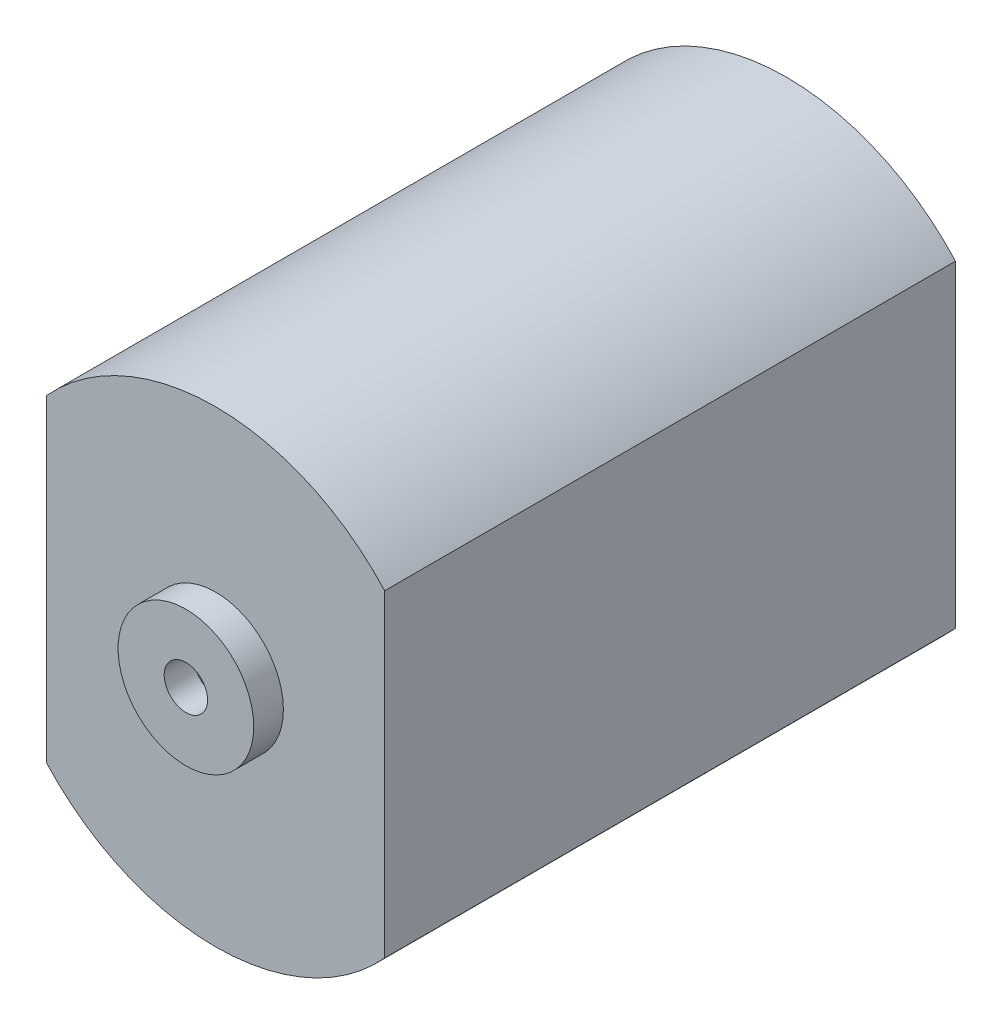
ISO-10303-21;
HEADER;
FILE_DESCRIPTION(('STEP AP214'),'2;1');
FILE_NAME('part.step','',(''),(''),'','','');
FILE_SCHEMA(('AUTOMOTIVE_DESIGN { 1 0 10303 214 1 1 1 1 }'));
ENDSEC;
DATA;
#1=APPLICATION_CONTEXT('core data for automotive mechanical design processes');
#2=APPLICATION_PROTOCOL_DEFINITION('international standard','automotive_design',2000,#1);
#3=PRODUCT_CONTEXT('',#1,'mechanical');
#4=PRODUCT('Part','Part','',(#3));
#5=PRODUCT_RELATED_PRODUCT_CATEGORY('part','',(#4));
#6=PRODUCT_DEFINITION_FORMATION('','',#4);
#7=PRODUCT_DEFINITION_CONTEXT('part definition',#1,'design');
#8=PRODUCT_DEFINITION('design','',#6,#7);
#9=PRODUCT_DEFINITION_SHAPE('','',#8);
#10=(LENGTH_UNIT() NAMED_UNIT(*) SI_UNIT(.MILLI.,.METRE.));
#11=(NAMED_UNIT(*) PLANE_ANGLE_UNIT() SI_UNIT($,.RADIAN.));
#12=(NAMED_UNIT(*) SI_UNIT($,.STERADIAN.) SOLID_ANGLE_UNIT());
#13=UNCERTAINTY_MEASURE_WITH_UNIT(LENGTH_MEASURE(1.E-05),#10,'distance_accuracy_value','');
#14=(GEOMETRIC_REPRESENTATION_CONTEXT(3) GLOBAL_UNCERTAINTY_ASSIGNED_CONTEXT((#13)) GLOBAL_UNIT_ASSIGNED_CONTEXT((#10,
#11,#12)) REPRESENTATION_CONTEXT('',''));
#15=CARTESIAN_POINT('',(0.,0.,0.));
#16=DIRECTION('',(0.,0.,1.));
#17=DIRECTION('',(1.,0.,0.));
#18=AXIS2_PLACEMENT_3D('',#15,#16,#17);
#19=CARTESIAN_POINT('',(-7.405,6.72056359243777,25.));
#20=DIRECTION('',(0.,0.,-1.));
#21=DIRECTION('',(-1.,0.,0.));
#22=AXIS2_PLACEMENT_3D('',#19,#20,#21);
#23=CYLINDRICAL_SURFACE('',#22,10.);
#24=CARTESIAN_POINT('',(-7.405,6.72056359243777,0.));
#25=DIRECTION('',(0.,0.,1.));
#26=DIRECTION('',(1.,0.,0.));
#27=AXIS2_PLACEMENT_3D('',#24,#25,#26);
#28=CIRCLE('',#27,10.);
#29=CARTESIAN_POINT('',(-14.81,0.,0.));
#30=VERTEX_POINT('',#29);
#31=CARTESIAN_POINT('',(0.,0.,0.));
#32=VERTEX_POINT('',#31);
#33=EDGE_CURVE('E116',#30,#32,#28,.T.);
#34=ORIENTED_EDGE('',*,*,#33,.T.);
#35=DIRECTION('',(0.,0.,-1.));
#36=VECTOR('',#35,1.);
#37=CARTESIAN_POINT('',(0.,0.,25.));
#38=LINE('',#37,#36);
#39=CARTESIAN_POINT('',(0.,0.,25.));
#40=VERTEX_POINT('',#39);
#41=EDGE_CURVE('E48',#40,#32,#38,.T.);
#42=ORIENTED_EDGE('',*,*,#41,.F.);
#43=CARTESIAN_POINT('',(-7.405,6.72056359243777,25.));
#44=DIRECTION('',(0.,0.,1.));
#45=DIRECTION('',(1.,0.,0.));
#46=AXIS2_PLACEMENT_3D('',#43,#44,#45);
#47=CIRCLE('',#46,10.);
#48=CARTESIAN_POINT('',(-14.81,0.,25.));
#49=VERTEX_POINT('',#48);
#50=EDGE_CURVE('E99',#49,#40,#47,.T.);
#51=ORIENTED_EDGE('',*,*,#50,.F.);
#52=DIRECTION('',(0.,0.,-1.));
#53=VECTOR('',#52,1.);
#54=CARTESIAN_POINT('',(-14.81,0.,25.));
#55=LINE('',#54,#53);
#56=EDGE_CURVE('E112',#49,#30,#55,.T.);
#57=ORIENTED_EDGE('',*,*,#56,.T.);
#58=EDGE_LOOP('',(#34,#42,#51,#57));
#59=FACE_BOUND('',#58,.T.);
#60=ADVANCED_FACE('F45',(#59),#23,.T.);
#61=CARTESIAN_POINT('',(0.,0.,25.));
#62=DIRECTION('',(-1.,0.,0.));
#63=DIRECTION('',(0.,0.,1.));
#64=AXIS2_PLACEMENT_3D('',#61,#62,#63);
#65=PLANE('',#64);
#66=DIRECTION('',(0.,1.,0.));
#67=VECTOR('',#66,1.);
#68=CARTESIAN_POINT('',(0.,0.,0.));
#69=LINE('',#68,#67);
#70=CARTESIAN_POINT('',(0.,13.93,0.));
#71=VERTEX_POINT('',#70);
#72=EDGE_CURVE('E105',#32,#71,#69,.T.);
#73=ORIENTED_EDGE('',*,*,#72,.T.);
#74=DIRECTION('',(0.,0.,-1.));
#75=VECTOR('',#74,1.);
#76=CARTESIAN_POINT('',(0.,13.93,25.));
#77=LINE('',#76,#75);
#78=CARTESIAN_POINT('',(0.,13.93,25.));
#79=VERTEX_POINT('',#78);
#80=EDGE_CURVE('E103',#79,#71,#77,.T.);
#81=ORIENTED_EDGE('',*,*,#80,.F.);
#82=DIRECTION('',(0.,1.,0.));
#83=VECTOR('',#82,1.);
#84=CARTESIAN_POINT('',(0.,0.,25.));
#85=LINE('',#84,#83);
#86=EDGE_CURVE('E94',#40,#79,#85,.T.);
#87=ORIENTED_EDGE('',*,*,#86,.F.);
#88=ORIENTED_EDGE('',*,*,#41,.T.);
#89=EDGE_LOOP('',(#73,#81,#87,#88));
#90=FACE_BOUND('',#89,.T.);
#91=ADVANCED_FACE('F104',(#90),#65,.F.);
#92=CARTESIAN_POINT('',(-7.405,7.20943640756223,25.));
#93=DIRECTION('',(0.,0.,-1.));
#94=DIRECTION('',(-1.,0.,0.));
#95=AXIS2_PLACEMENT_3D('',#92,#93,#94);
#96=CYLINDRICAL_SURFACE('',#95,10.);
#97=CARTESIAN_POINT('',(-7.405,7.20943640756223,0.));
#98=DIRECTION('',(0.,0.,1.));
#99=DIRECTION('',(1.,0.,0.));
#100=AXIS2_PLACEMENT_3D('',#97,#98,#99);
#101=CIRCLE('',#100,10.);
#102=CARTESIAN_POINT('',(-14.81,13.93,0.));
#103=VERTEX_POINT('',#102);
#104=EDGE_CURVE('E80',#71,#103,#101,.T.);
#105=ORIENTED_EDGE('',*,*,#104,.T.);
#106=DIRECTION('',(0.,0.,-1.));
#107=VECTOR('',#106,1.);
#108=CARTESIAN_POINT('',(-14.81,13.93,25.));
#109=LINE('',#108,#107);
#110=CARTESIAN_POINT('',(-14.81,13.93,25.));
#111=VERTEX_POINT('',#110);
#112=EDGE_CURVE('E107',#111,#103,#109,.T.);
#113=ORIENTED_EDGE('',*,*,#112,.F.);
#114=CARTESIAN_POINT('',(-7.405,7.20943640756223,25.));
#115=DIRECTION('',(0.,0.,1.));
#116=DIRECTION('',(1.,0.,0.));
#117=AXIS2_PLACEMENT_3D('',#114,#115,#116);
#118=CIRCLE('',#117,10.);
#119=EDGE_CURVE('E97',#79,#111,#118,.T.);
#120=ORIENTED_EDGE('',*,*,#119,.F.);
#121=ORIENTED_EDGE('',*,*,#80,.T.);
#122=EDGE_LOOP('',(#105,#113,#120,#121));
#123=FACE_BOUND('',#122,.T.);
#124=ADVANCED_FACE('F108',(#123),#96,.T.);
#125=CARTESIAN_POINT('',(-14.81,13.93,25.));
#126=DIRECTION('',(1.,0.,0.));
#127=DIRECTION('',(0.,0.,-1.));
#128=AXIS2_PLACEMENT_3D('',#125,#126,#127);
#129=PLANE('',#128);
#130=DIRECTION('',(0.,-1.,0.));
#131=VECTOR('',#130,1.);
#132=CARTESIAN_POINT('',(-14.81,13.93,0.));
#133=LINE('',#132,#131);
#134=EDGE_CURVE('E86',#103,#30,#133,.T.);
#135=ORIENTED_EDGE('',*,*,#134,.T.);
#136=ORIENTED_EDGE('',*,*,#56,.F.);
#137=DIRECTION('',(0.,-1.,0.));
#138=VECTOR('',#137,1.);
#139=CARTESIAN_POINT('',(-14.81,13.93,25.));
#140=LINE('',#139,#138);
#141=EDGE_CURVE('E63',#111,#49,#140,.T.);
#142=ORIENTED_EDGE('',*,*,#141,.F.);
#143=ORIENTED_EDGE('',*,*,#112,.T.);
#144=EDGE_LOOP('',(#135,#136,#142,#143));
#145=FACE_BOUND('',#144,.T.);
#146=ADVANCED_FACE('F130',(#145),#129,.F.);
#147=CARTESIAN_POINT('',(-7.405,6.72056359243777,25.));
#148=DIRECTION('',(0.,0.,1.));
#149=DIRECTION('',(1.,0.,0.));
#150=AXIS2_PLACEMENT_3D('',#147,#148,#149);
#151=PLANE('',#150);
#152=CARTESIAN_POINT('',(-7.405,7.20943640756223,25.));
#153=DIRECTION('',(0.,0.,1.));
#154=DIRECTION('',(1.,0.,0.));
#155=AXIS2_PLACEMENT_3D('',#152,#153,#154);
#156=CIRCLE('',#155,2.97);
#157=CARTESIAN_POINT('',(-4.435,7.20943640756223,25.));
#158=VERTEX_POINT('',#157);
#159=EDGE_CURVE('E11',#158,#158,#156,.T.);
#160=ORIENTED_EDGE('',*,*,#159,.F.);
#161=EDGE_LOOP('',(#160));
#162=FACE_BOUND('',#161,.T.);
#163=ORIENTED_EDGE('',*,*,#50,.T.);
#164=ORIENTED_EDGE('',*,*,#86,.T.);
#165=ORIENTED_EDGE('',*,*,#119,.T.);
#166=ORIENTED_EDGE('',*,*,#141,.T.);
#167=EDGE_LOOP('',(#163,#164,#165,#166));
#168=FACE_BOUND('',#167,.T.);
#169=ADVANCED_FACE('F95',(#162,#168),#151,.T.);
#170=CARTESIAN_POINT('',(-7.405,6.72056359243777,0.));
#171=DIRECTION('',(0.,0.,1.));
#172=DIRECTION('',(1.,0.,0.));
#173=AXIS2_PLACEMENT_3D('',#170,#171,#172);
#174=PLANE('',#173);
#175=ORIENTED_EDGE('',*,*,#33,.F.);
#176=ORIENTED_EDGE('',*,*,#134,.F.);
#177=ORIENTED_EDGE('',*,*,#104,.F.);
#178=ORIENTED_EDGE('',*,*,#72,.F.);
#179=EDGE_LOOP('',(#175,#176,#177,#178));
#180=FACE_BOUND('',#179,.T.);
#181=ADVANCED_FACE('F133',(#180),#174,.F.);
#182=CARTESIAN_POINT('',(-7.405,7.20943640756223,26.3));
#183=DIRECTION('',(0.,0.,-1.));
#184=DIRECTION('',(-1.,0.,0.));
#185=AXIS2_PLACEMENT_3D('',#182,#183,#184);
#186=CYLINDRICAL_SURFACE('',#185,2.97);
#187=CARTESIAN_POINT('',(-7.405,7.20943640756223,26.3));
#188=DIRECTION('',(0.,0.,1.));
#189=DIRECTION('',(1.,0.,0.));
#190=AXIS2_PLACEMENT_3D('',#187,#188,#189);
#191=CIRCLE('',#190,2.97);
#192=CARTESIAN_POINT('',(-4.435,7.20943640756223,26.3));
#193=VERTEX_POINT('',#192);
#194=EDGE_CURVE('E120',#193,#193,#191,.T.);
#195=ORIENTED_EDGE('',*,*,#194,.F.);
#196=EDGE_LOOP('',(#195));
#197=FACE_BOUND('',#196,.T.);
#198=ORIENTED_EDGE('',*,*,#159,.T.);
#199=EDGE_LOOP('',(#198));
#200=FACE_BOUND('',#199,.T.);
#201=ADVANCED_FACE('F154',(#197,#200),#186,.T.);
#202=CARTESIAN_POINT('',(-7.405,7.20943640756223,26.3));
#203=DIRECTION('',(0.,0.,1.));
#204=DIRECTION('',(1.,0.,0.));
#205=AXIS2_PLACEMENT_3D('',#202,#203,#204);
#206=PLANE('',#205);
#207=CARTESIAN_POINT('',(-7.405,7.20943640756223,26.3));
#208=DIRECTION('',(0.,0.,1.));
#209=DIRECTION('',(1.,0.,0.));
#210=AXIS2_PLACEMENT_3D('',#207,#208,#209);
#211=CIRCLE('',#210,0.95);
#212=CARTESIAN_POINT('',(-6.455,7.20943640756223,26.3));
#213=VERTEX_POINT('',#212);
#214=EDGE_CURVE('E144',#213,#213,#211,.T.);
#215=ORIENTED_EDGE('',*,*,#214,.F.);
#216=EDGE_LOOP('',(#215));
#217=FACE_BOUND('',#216,.T.);
#218=ORIENTED_EDGE('',*,*,#194,.T.);
#219=EDGE_LOOP('',(#218));
#220=FACE_BOUND('',#219,.T.);
#221=ADVANCED_FACE('F151',(#217,#220),#206,.T.);
#222=CARTESIAN_POINT('',(-7.405,7.20943640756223,22.3129942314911));
#223=DIRECTION('',(0.,0.,1.));
#224=DIRECTION('',(1.,0.,0.));
#225=AXIS2_PLACEMENT_3D('',#222,#223,#224);
#226=CYLINDRICAL_SURFACE('',#225,0.95);
#227=CARTESIAN_POINT('',(-7.405,7.20943640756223,25.));
#228=DIRECTION('',(0.,0.,1.));
#229=DIRECTION('',(1.,0.,0.));
#230=AXIS2_PLACEMENT_3D('',#227,#228,#229);
#231=CIRCLE('',#230,0.95);
#232=CARTESIAN_POINT('',(-6.455,7.20943640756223,25.));
#233=VERTEX_POINT('',#232);
#234=EDGE_CURVE('E140',#233,#233,#231,.F.);
#235=ORIENTED_EDGE('',*,*,#234,.T.);
#236=EDGE_LOOP('',(#235));
#237=FACE_BOUND('',#236,.T.);
#238=ORIENTED_EDGE('',*,*,#214,.T.);
#239=EDGE_LOOP('',(#238));
#240=FACE_BOUND('',#239,.T.);
#241=ADVANCED_FACE('F149',(#237,#240),#226,.F.);
#242=CARTESIAN_POINT('',(-7.405,6.72056359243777,25.));
#243=DIRECTION('',(0.,0.,1.));
#244=DIRECTION('',(1.,0.,0.));
#245=AXIS2_PLACEMENT_3D('',#242,#243,#244);
#246=PLANE('',#245);
#247=ORIENTED_EDGE('',*,*,#234,.F.);
#248=EDGE_LOOP('',(#247));
#249=FACE_BOUND('',#248,.T.);
#250=ADVANCED_FACE('F216',(#249),#246,.T.);
#251=CLOSED_SHELL('',(#60,#91,#124,#146,#169,#181,#201,#221,#241,#250));
#252=MANIFOLD_SOLID_BREP('B2',#251);
#253=ADVANCED_BREP_SHAPE_REPRESENTATION('',(#18,#252),#14);
#254=SHAPE_DEFINITION_REPRESENTATION(#9,#253);
ENDSEC;
END-ISO-10303-21;
